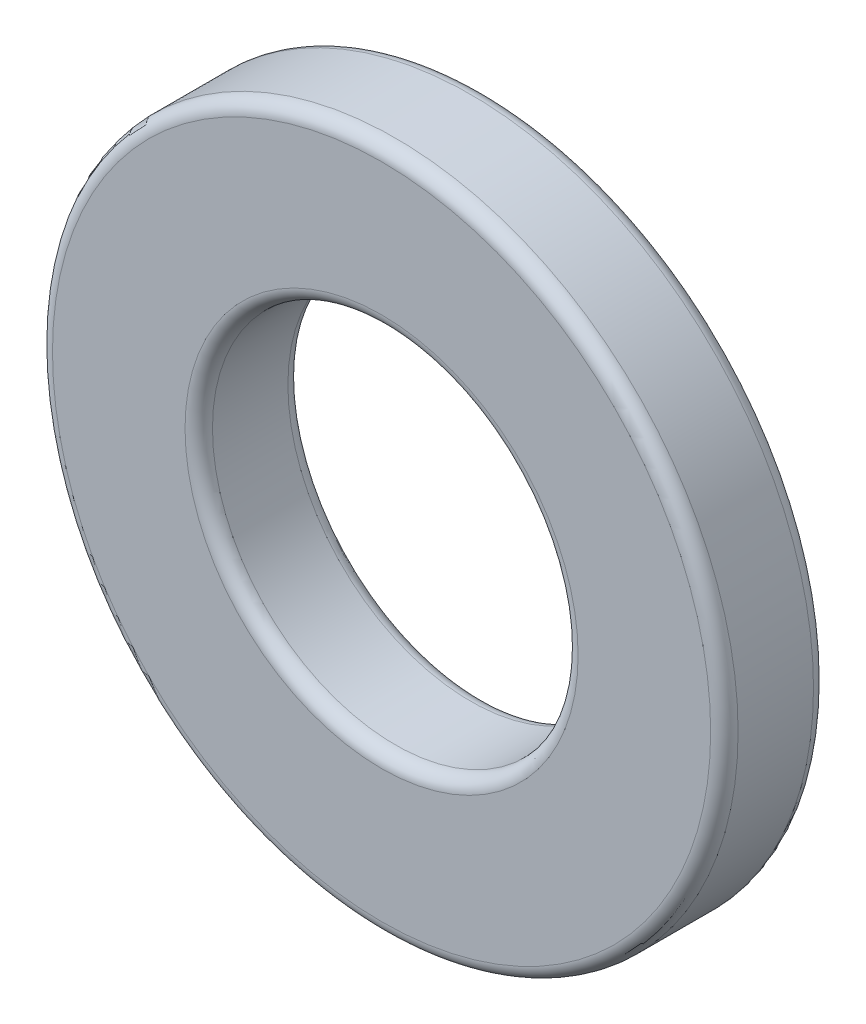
from build123d import *

# Parameters (mm, degrees)
BOSS_EXTRUDE1_DEPTH      = 0.9
BOSS_EXTRUDE1_DEPTH_BACK = 0.9
SKETCH3_R                = 6
SKETCH3_R_2              = 3.2
FILLET1_R                = 0.24


with BuildPart() as part:
    # Sketch3 → Boss-Extrude1 (new, two sides: drawn at the far end of the back side and taken through both)
    with BuildSketch(Plane.XY.offset(-BOSS_EXTRUDE1_DEPTH_BACK)):
        Circle(SKETCH3_R)
        Circle(SKETCH3_R_2, mode=Mode.SUBTRACT)
    extrude(amount=BOSS_EXTRUDE1_DEPTH + BOSS_EXTRUDE1_DEPTH_BACK)

    # Fillet1
    fillet1_edges = [part.edges().sort_by_distance(p)[0] for p in [
        (-6, 0, -0.9),
        (-3.2, 0, -0.9),
        (-6, 0, 0.9),
        (-3.2, 0, 0.9),
    ]]
    fillet(fillet1_edges, radius=FILLET1_R)


solid = part.part
